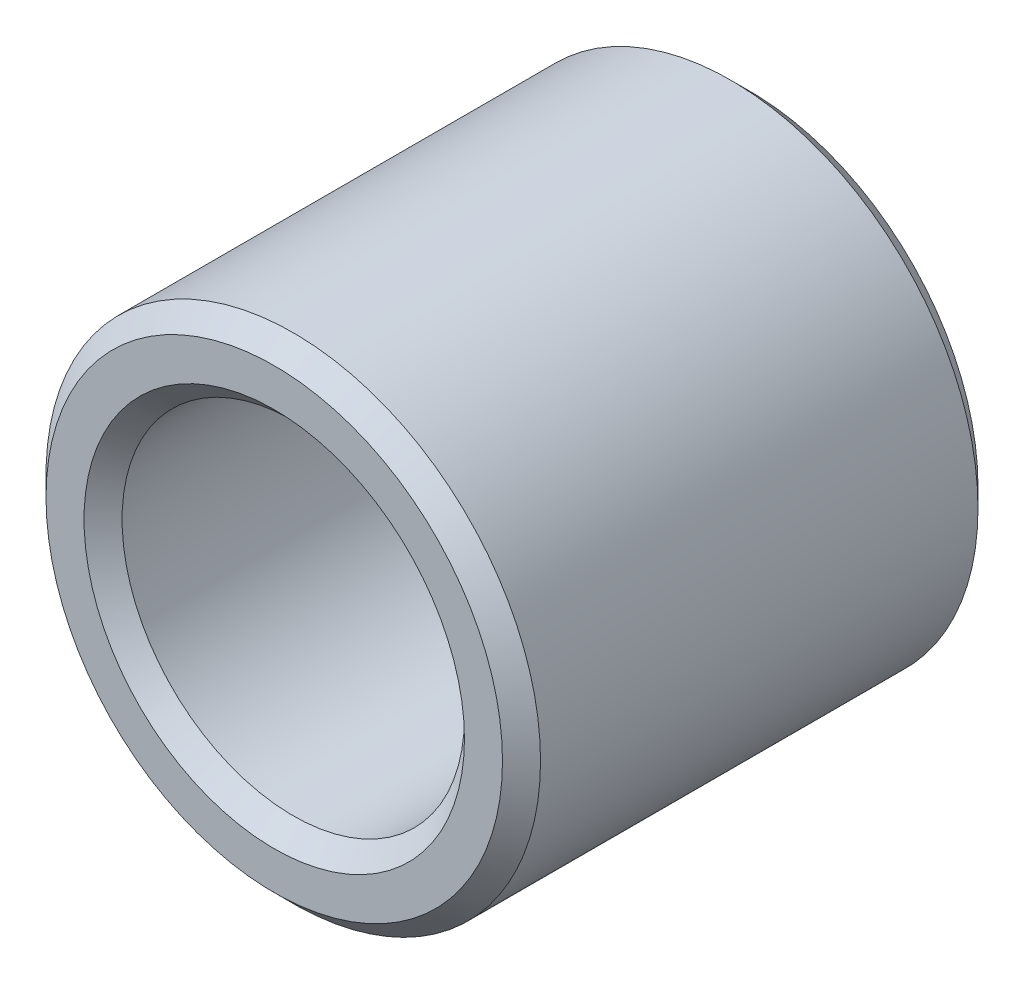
from build123d import *

# Parameters (mm, degrees)
ESQUISSE1_R          = 6.5
ESQUISSE1_R_2        = 4.5
BASE_EXTRUSION_DEPTH = 12.5
CHANFREIN1_SIZE      = 0.5


with BuildPart() as part:
    # Esquisse1 → Base-Extrusion (new body)
    with BuildSketch(Plane.XY):
        Circle(ESQUISSE1_R)
        Circle(ESQUISSE1_R_2, mode=Mode.SUBTRACT)
    extrude(amount=BASE_EXTRUSION_DEPTH)

    # Chanfrein1
    chanfrein1_edges = [part.edges().sort_by_distance(p)[0] for p in [
        (-6.5, 0, 0),
        (-6.5, 0, 12.5),
        (-4.5, 0, 0),
        (-4.5, 0, 12.5),
    ]]
    chamfer(chanfrein1_edges, length=CHANFREIN1_SIZE)


solid = part.part
